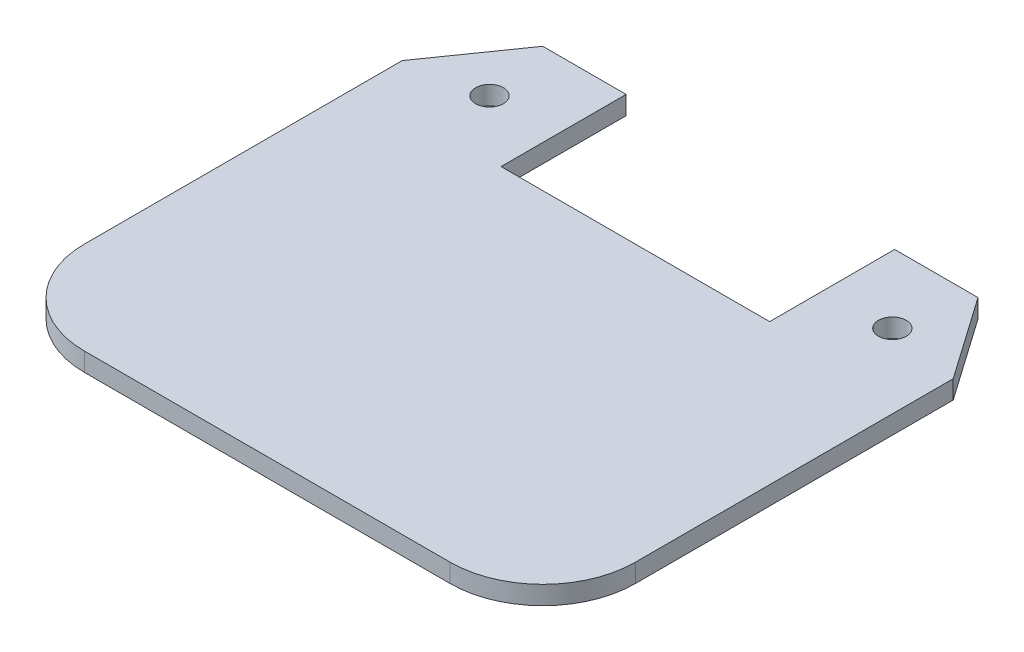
ISO-10303-21;
HEADER;
FILE_DESCRIPTION(('STEP AP214'),'2;1');
FILE_NAME('part.step','',(''),(''),'','','');
FILE_SCHEMA(('AUTOMOTIVE_DESIGN { 1 0 10303 214 1 1 1 1 }'));
ENDSEC;
DATA;
#1=APPLICATION_CONTEXT('core data for automotive mechanical design processes');
#2=APPLICATION_PROTOCOL_DEFINITION('international standard','automotive_design',2000,#1);
#3=PRODUCT_CONTEXT('',#1,'mechanical');
#4=PRODUCT('Part','Part','',(#3));
#5=PRODUCT_RELATED_PRODUCT_CATEGORY('part','',(#4));
#6=PRODUCT_DEFINITION_FORMATION('','',#4);
#7=PRODUCT_DEFINITION_CONTEXT('part definition',#1,'design');
#8=PRODUCT_DEFINITION('design','',#6,#7);
#9=PRODUCT_DEFINITION_SHAPE('','',#8);
#10=(LENGTH_UNIT() NAMED_UNIT(*) SI_UNIT(.MILLI.,.METRE.));
#11=(NAMED_UNIT(*) PLANE_ANGLE_UNIT() SI_UNIT($,.RADIAN.));
#12=(NAMED_UNIT(*) SI_UNIT($,.STERADIAN.) SOLID_ANGLE_UNIT());
#13=UNCERTAINTY_MEASURE_WITH_UNIT(LENGTH_MEASURE(1.E-05),#10,'distance_accuracy_value','');
#14=(GEOMETRIC_REPRESENTATION_CONTEXT(3) GLOBAL_UNCERTAINTY_ASSIGNED_CONTEXT((#13)) GLOBAL_UNIT_ASSIGNED_CONTEXT((#10,
#11,#12)) REPRESENTATION_CONTEXT('',''));
#15=CARTESIAN_POINT('',(0.,0.,0.));
#16=DIRECTION('',(0.,0.,1.));
#17=DIRECTION('',(1.,0.,0.));
#18=AXIS2_PLACEMENT_3D('',#15,#16,#17);
#19=CARTESIAN_POINT('',(4.7,0.4,-5.325));
#20=DIRECTION('',(0.,0.,1.));
#21=DIRECTION('',(1.,0.,0.));
#22=AXIS2_PLACEMENT_3D('',#19,#20,#21);
#23=PLANE('',#22);
#24=DIRECTION('',(-1.,0.,0.));
#25=VECTOR('',#24,1.);
#26=CARTESIAN_POINT('',(4.7,0.,-5.325));
#27=LINE('',#26,#25);
#28=CARTESIAN_POINT('',(4.7,0.,-5.325));
#29=VERTEX_POINT('',#28);
#30=CARTESIAN_POINT('',(2.9,0.,-5.325));
#31=VERTEX_POINT('',#30);
#32=EDGE_CURVE('E146',#29,#31,#27,.T.);
#33=ORIENTED_EDGE('',*,*,#32,.T.);
#34=DIRECTION('',(0.,1.,0.));
#35=VECTOR('',#34,1.);
#36=CARTESIAN_POINT('',(2.9,-9.6,-5.325));
#37=LINE('',#36,#35);
#38=CARTESIAN_POINT('',(2.9,0.4,-5.325));
#39=VERTEX_POINT('',#38);
#40=EDGE_CURVE('E130',#31,#39,#37,.T.);
#41=ORIENTED_EDGE('',*,*,#40,.T.);
#42=DIRECTION('',(-1.,0.,0.));
#43=VECTOR('',#42,1.);
#44=CARTESIAN_POINT('',(4.7,0.4,-5.325));
#45=LINE('',#44,#43);
#46=CARTESIAN_POINT('',(4.7,0.4,-5.325));
#47=VERTEX_POINT('',#46);
#48=EDGE_CURVE('E144',#47,#39,#45,.T.);
#49=ORIENTED_EDGE('',*,*,#48,.F.);
#50=DIRECTION('',(0.,-1.,0.));
#51=VECTOR('',#50,1.);
#52=CARTESIAN_POINT('',(4.7,0.4,-5.325));
#53=LINE('',#52,#51);
#54=EDGE_CURVE('E182',#47,#29,#53,.T.);
#55=ORIENTED_EDGE('',*,*,#54,.T.);
#56=EDGE_LOOP('',(#33,#41,#49,#55));
#57=FACE_BOUND('',#56,.T.);
#58=ADVANCED_FACE('F36',(#57),#23,.F.);
#59=CARTESIAN_POINT('',(-5.95,0.4,-3.53981499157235));
#60=DIRECTION('',(1.,0.,0.));
#61=DIRECTION('',(0.,0.,-1.));
#62=AXIS2_PLACEMENT_3D('',#59,#60,#61);
#63=PLANE('',#62);
#64=DIRECTION('',(0.,0.,1.));
#65=VECTOR('',#64,1.);
#66=CARTESIAN_POINT('',(-5.95,0.,-3.53981499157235));
#67=LINE('',#66,#65);
#68=CARTESIAN_POINT('',(-5.95,0.,-3.53981499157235));
#69=VERTEX_POINT('',#68);
#70=CARTESIAN_POINT('',(-5.95,0.,3.325));
#71=VERTEX_POINT('',#70);
#72=EDGE_CURVE('E162',#69,#71,#67,.T.);
#73=ORIENTED_EDGE('',*,*,#72,.T.);
#74=DIRECTION('',(0.,-1.,0.));
#75=VECTOR('',#74,1.);
#76=CARTESIAN_POINT('',(-5.95,0.4,3.325));
#77=LINE('',#76,#75);
#78=CARTESIAN_POINT('',(-5.95,0.4,3.325));
#79=VERTEX_POINT('',#78);
#80=EDGE_CURVE('E59',#71,#79,#77,.F.);
#81=ORIENTED_EDGE('',*,*,#80,.T.);
#82=DIRECTION('',(0.,0.,1.));
#83=VECTOR('',#82,1.);
#84=CARTESIAN_POINT('',(-5.95,0.4,-3.53981499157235));
#85=LINE('',#84,#83);
#86=CARTESIAN_POINT('',(-5.95,0.4,-3.53981499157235));
#87=VERTEX_POINT('',#86);
#88=EDGE_CURVE('E176',#87,#79,#85,.T.);
#89=ORIENTED_EDGE('',*,*,#88,.F.);
#90=DIRECTION('',(0.,-1.,0.));
#91=VECTOR('',#90,1.);
#92=CARTESIAN_POINT('',(-5.95,0.4,-3.53981499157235));
#93=LINE('',#92,#91);
#94=EDGE_CURVE('E157',#87,#69,#93,.T.);
#95=ORIENTED_EDGE('',*,*,#94,.T.);
#96=EDGE_LOOP('',(#73,#81,#89,#95));
#97=FACE_BOUND('',#96,.T.);
#98=ADVANCED_FACE('F226',(#97),#63,.F.);
#99=CARTESIAN_POINT('',(-5.95,0.4,5.325));
#100=DIRECTION('',(0.,0.,-1.));
#101=DIRECTION('',(-1.,0.,0.));
#102=AXIS2_PLACEMENT_3D('',#99,#100,#101);
#103=PLANE('',#102);
#104=DIRECTION('',(1.,0.,0.));
#105=VECTOR('',#104,1.);
#106=CARTESIAN_POINT('',(-5.95,0.4,5.325));
#107=LINE('',#106,#105);
#108=CARTESIAN_POINT('',(-3.95,0.4,5.325));
#109=VERTEX_POINT('',#108);
#110=CARTESIAN_POINT('',(3.95,0.4,5.325));
#111=VERTEX_POINT('',#110);
#112=EDGE_CURVE('E212',#109,#111,#107,.T.);
#113=ORIENTED_EDGE('',*,*,#112,.F.);
#114=DIRECTION('',(0.,-1.,0.));
#115=VECTOR('',#114,1.);
#116=CARTESIAN_POINT('',(-3.95,0.4,5.325));
#117=LINE('',#116,#115);
#118=CARTESIAN_POINT('',(-3.95,0.,5.325));
#119=VERTEX_POINT('',#118);
#120=EDGE_CURVE('E202',#109,#119,#117,.T.);
#121=ORIENTED_EDGE('',*,*,#120,.T.);
#122=DIRECTION('',(1.,0.,0.));
#123=VECTOR('',#122,1.);
#124=CARTESIAN_POINT('',(-5.95,0.,5.325));
#125=LINE('',#124,#123);
#126=CARTESIAN_POINT('',(3.95,0.,5.325));
#127=VERTEX_POINT('',#126);
#128=EDGE_CURVE('E164',#119,#127,#125,.T.);
#129=ORIENTED_EDGE('',*,*,#128,.T.);
#130=DIRECTION('',(0.,-1.,0.));
#131=VECTOR('',#130,1.);
#132=CARTESIAN_POINT('',(3.95,0.4,5.325));
#133=LINE('',#132,#131);
#134=EDGE_CURVE('E195',#127,#111,#133,.F.);
#135=ORIENTED_EDGE('',*,*,#134,.T.);
#136=EDGE_LOOP('',(#113,#121,#129,#135));
#137=FACE_BOUND('',#136,.T.);
#138=ADVANCED_FACE('F216',(#137),#103,.F.);
#139=CARTESIAN_POINT('',(5.95,0.4,-3.53981499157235));
#140=DIRECTION('',(-1.,0.,0.));
#141=DIRECTION('',(0.,0.,1.));
#142=AXIS2_PLACEMENT_3D('',#139,#140,#141);
#143=PLANE('',#142);
#144=DIRECTION('',(0.,0.,-1.));
#145=VECTOR('',#144,1.);
#146=CARTESIAN_POINT('',(5.95,0.4,-3.53981499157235));
#147=LINE('',#146,#145);
#148=CARTESIAN_POINT('',(5.95,0.4,3.325));
#149=VERTEX_POINT('',#148);
#150=CARTESIAN_POINT('',(5.95,0.4,-3.53981499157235));
#151=VERTEX_POINT('',#150);
#152=EDGE_CURVE('E219',#149,#151,#147,.T.);
#153=ORIENTED_EDGE('',*,*,#152,.F.);
#154=DIRECTION('',(0.,-1.,0.));
#155=VECTOR('',#154,1.);
#156=CARTESIAN_POINT('',(5.95,0.4,3.325));
#157=LINE('',#156,#155);
#158=CARTESIAN_POINT('',(5.95,0.,3.325));
#159=VERTEX_POINT('',#158);
#160=EDGE_CURVE('E11',#149,#159,#157,.T.);
#161=ORIENTED_EDGE('',*,*,#160,.T.);
#162=DIRECTION('',(0.,0.,-1.));
#163=VECTOR('',#162,1.);
#164=CARTESIAN_POINT('',(5.95,0.,-3.53981499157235));
#165=LINE('',#164,#163);
#166=CARTESIAN_POINT('',(5.95,0.,-3.53981499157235));
#167=VERTEX_POINT('',#166);
#168=EDGE_CURVE('E168',#159,#167,#165,.T.);
#169=ORIENTED_EDGE('',*,*,#168,.T.);
#170=DIRECTION('',(0.,-1.,0.));
#171=VECTOR('',#170,1.);
#172=CARTESIAN_POINT('',(5.95,0.4,-3.53981499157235));
#173=LINE('',#172,#171);
#174=EDGE_CURVE('E184',#151,#167,#173,.T.);
#175=ORIENTED_EDGE('',*,*,#174,.F.);
#176=EDGE_LOOP('',(#153,#161,#169,#175));
#177=FACE_BOUND('',#176,.T.);
#178=ADVANCED_FACE('F248',(#177),#143,.F.);
#179=CARTESIAN_POINT('',(5.95,0.4,-3.53981499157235));
#180=DIRECTION('',(-0.819152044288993,0.,0.573576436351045));
#181=DIRECTION('',(0.573576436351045,0.,0.819152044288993));
#182=AXIS2_PLACEMENT_3D('',#179,#180,#181);
#183=PLANE('',#182);
#184=DIRECTION('',(-0.573576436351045,0.,-0.819152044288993));
#185=VECTOR('',#184,1.);
#186=CARTESIAN_POINT('',(5.95,0.,-3.53981499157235));
#187=LINE('',#186,#185);
#188=EDGE_CURVE('E170',#167,#29,#187,.T.);
#189=ORIENTED_EDGE('',*,*,#188,.T.);
#190=ORIENTED_EDGE('',*,*,#54,.F.);
#191=DIRECTION('',(-0.573576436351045,0.,-0.819152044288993));
#192=VECTOR('',#191,1.);
#193=CARTESIAN_POINT('',(5.95,0.4,-3.53981499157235));
#194=LINE('',#193,#192);
#195=EDGE_CURVE('E152',#151,#47,#194,.T.);
#196=ORIENTED_EDGE('',*,*,#195,.F.);
#197=ORIENTED_EDGE('',*,*,#174,.T.);
#198=EDGE_LOOP('',(#189,#190,#196,#197));
#199=FACE_BOUND('',#198,.T.);
#200=ADVANCED_FACE('F252',(#199),#183,.F.);
#201=CARTESIAN_POINT('',(-2.9,0.4,-5.325));
#202=VERTEX_POINT('',#201);
#203=CARTESIAN_POINT('',(-4.7,0.4,-5.325));
#204=VERTEX_POINT('',#203);
#205=EDGE_CURVE('E155',#202,#204,#45,.T.);
#206=ORIENTED_EDGE('',*,*,#205,.F.);
#207=DIRECTION('',(0.,1.,0.));
#208=VECTOR('',#207,1.);
#209=CARTESIAN_POINT('',(-2.9,-9.6,-5.325));
#210=LINE('',#209,#208);
#211=CARTESIAN_POINT('',(-2.9,0.,-5.325));
#212=VERTEX_POINT('',#211);
#213=EDGE_CURVE('E147',#212,#202,#210,.T.);
#214=ORIENTED_EDGE('',*,*,#213,.F.);
#215=CARTESIAN_POINT('',(-4.7,0.,-5.325));
#216=VERTEX_POINT('',#215);
#217=EDGE_CURVE('E172',#212,#216,#27,.T.);
#218=ORIENTED_EDGE('',*,*,#217,.T.);
#219=DIRECTION('',(0.,-1.,0.));
#220=VECTOR('',#219,1.);
#221=CARTESIAN_POINT('',(-4.7,0.4,-5.325));
#222=LINE('',#221,#220);
#223=EDGE_CURVE('E179',#204,#216,#222,.T.);
#224=ORIENTED_EDGE('',*,*,#223,.F.);
#225=EDGE_LOOP('',(#206,#214,#218,#224));
#226=FACE_BOUND('',#225,.T.);
#227=ADVANCED_FACE('F236',(#226),#23,.F.);
#228=CARTESIAN_POINT('',(-4.7,0.4,-5.325));
#229=DIRECTION('',(0.819152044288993,0.,0.573576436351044));
#230=DIRECTION('',(0.573576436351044,0.,-0.819152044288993));
#231=AXIS2_PLACEMENT_3D('',#228,#229,#230);
#232=PLANE('',#231);
#233=DIRECTION('',(-0.573576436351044,0.,0.819152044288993));
#234=VECTOR('',#233,1.);
#235=CARTESIAN_POINT('',(-4.7,0.,-5.325));
#236=LINE('',#235,#234);
#237=EDGE_CURVE('E174',#216,#69,#236,.T.);
#238=ORIENTED_EDGE('',*,*,#237,.T.);
#239=ORIENTED_EDGE('',*,*,#94,.F.);
#240=DIRECTION('',(-0.573576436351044,0.,0.819152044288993));
#241=VECTOR('',#240,1.);
#242=CARTESIAN_POINT('',(-4.7,0.4,-5.325));
#243=LINE('',#242,#241);
#244=EDGE_CURVE('E154',#204,#87,#243,.T.);
#245=ORIENTED_EDGE('',*,*,#244,.F.);
#246=ORIENTED_EDGE('',*,*,#223,.T.);
#247=EDGE_LOOP('',(#238,#239,#245,#246));
#248=FACE_BOUND('',#247,.T.);
#249=ADVANCED_FACE('F230',(#248),#232,.F.);
#250=CARTESIAN_POINT('',(0.,0.4,0.));
#251=DIRECTION('',(0.,1.,0.));
#252=DIRECTION('',(0.,0.,1.));
#253=AXIS2_PLACEMENT_3D('',#250,#251,#252);
#254=PLANE('',#253);
#255=CARTESIAN_POINT('',(4.35,0.4,-3.825));
#256=DIRECTION('',(0.,1.,0.));
#257=DIRECTION('',(0.,0.,1.));
#258=AXIS2_PLACEMENT_3D('',#255,#256,#257);
#259=CIRCLE('',#258,0.3);
#260=CARTESIAN_POINT('',(4.35,0.4,-3.525));
#261=VERTEX_POINT('',#260);
#262=EDGE_CURVE('E259',#261,#261,#259,.T.);
#263=ORIENTED_EDGE('',*,*,#262,.F.);
#264=EDGE_LOOP('',(#263));
#265=FACE_BOUND('',#264,.T.);
#266=CARTESIAN_POINT('',(-4.35,0.4,-3.825));
#267=DIRECTION('',(0.,1.,0.));
#268=DIRECTION('',(0.,0.,1.));
#269=AXIS2_PLACEMENT_3D('',#266,#267,#268);
#270=CIRCLE('',#269,0.3);
#271=CARTESIAN_POINT('',(-4.35,0.4,-3.525));
#272=VERTEX_POINT('',#271);
#273=EDGE_CURVE('E138',#272,#272,#270,.T.);
#274=ORIENTED_EDGE('',*,*,#273,.F.);
#275=EDGE_LOOP('',(#274));
#276=FACE_BOUND('',#275,.T.);
#277=ORIENTED_EDGE('',*,*,#88,.T.);
#278=CARTESIAN_POINT('',(-3.95,0.4,3.325));
#279=DIRECTION('',(0.,1.,0.));
#280=DIRECTION('',(0.,0.,1.));
#281=AXIS2_PLACEMENT_3D('',#278,#279,#280);
#282=CIRCLE('',#281,2.);
#283=EDGE_CURVE('E44',#79,#109,#282,.T.);
#284=ORIENTED_EDGE('',*,*,#283,.T.);
#285=ORIENTED_EDGE('',*,*,#112,.T.);
#286=CARTESIAN_POINT('',(3.95,0.4,3.325));
#287=DIRECTION('',(0.,1.,0.));
#288=DIRECTION('',(0.,0.,1.));
#289=AXIS2_PLACEMENT_3D('',#286,#287,#288);
#290=CIRCLE('',#289,2.);
#291=EDGE_CURVE('E51',#111,#149,#290,.T.);
#292=ORIENTED_EDGE('',*,*,#291,.T.);
#293=ORIENTED_EDGE('',*,*,#152,.T.);
#294=ORIENTED_EDGE('',*,*,#195,.T.);
#295=ORIENTED_EDGE('',*,*,#48,.T.);
#296=DIRECTION('',(0.,0.,-1.));
#297=VECTOR('',#296,1.);
#298=CARTESIAN_POINT('',(2.9,0.4,-5.325));
#299=LINE('',#298,#297);
#300=CARTESIAN_POINT('',(2.9,0.4,-2.625));
#301=VERTEX_POINT('',#300);
#302=EDGE_CURVE('E127',#301,#39,#299,.T.);
#303=ORIENTED_EDGE('',*,*,#302,.F.);
#304=DIRECTION('',(1.,0.,0.));
#305=VECTOR('',#304,1.);
#306=CARTESIAN_POINT('',(2.9,0.4,-2.625));
#307=LINE('',#306,#305);
#308=CARTESIAN_POINT('',(-2.9,0.4,-2.625));
#309=VERTEX_POINT('',#308);
#310=EDGE_CURVE('E148',#309,#301,#307,.T.);
#311=ORIENTED_EDGE('',*,*,#310,.F.);
#312=DIRECTION('',(0.,0.,1.));
#313=VECTOR('',#312,1.);
#314=CARTESIAN_POINT('',(-2.9,0.4,-5.325));
#315=LINE('',#314,#313);
#316=EDGE_CURVE('E137',#202,#309,#315,.T.);
#317=ORIENTED_EDGE('',*,*,#316,.F.);
#318=ORIENTED_EDGE('',*,*,#205,.T.);
#319=ORIENTED_EDGE('',*,*,#244,.T.);
#320=EDGE_LOOP('',(#277,#284,#285,#292,#293,#294,#295,#303,#311,#317,#318,#319));
#321=FACE_BOUND('',#320,.T.);
#322=ADVANCED_FACE('F150',(#265,#276,#321),#254,.T.);
#323=CARTESIAN_POINT('',(0.,0.,0.));
#324=DIRECTION('',(0.,1.,0.));
#325=DIRECTION('',(0.,0.,1.));
#326=AXIS2_PLACEMENT_3D('',#323,#324,#325);
#327=PLANE('',#326);
#328=CARTESIAN_POINT('',(4.35,0.,-3.825));
#329=DIRECTION('',(0.,1.,0.));
#330=DIRECTION('',(0.,0.,1.));
#331=AXIS2_PLACEMENT_3D('',#328,#329,#330);
#332=CIRCLE('',#331,0.3);
#333=CARTESIAN_POINT('',(4.35,0.,-3.525));
#334=VERTEX_POINT('',#333);
#335=EDGE_CURVE('E165',#334,#334,#332,.T.);
#336=ORIENTED_EDGE('',*,*,#335,.T.);
#337=EDGE_LOOP('',(#336));
#338=FACE_BOUND('',#337,.T.);
#339=CARTESIAN_POINT('',(-4.35,0.,-3.825));
#340=DIRECTION('',(0.,1.,0.));
#341=DIRECTION('',(0.,0.,1.));
#342=AXIS2_PLACEMENT_3D('',#339,#340,#341);
#343=CIRCLE('',#342,0.3);
#344=CARTESIAN_POINT('',(-4.35,0.,-3.525));
#345=VERTEX_POINT('',#344);
#346=EDGE_CURVE('E196',#345,#345,#343,.T.);
#347=ORIENTED_EDGE('',*,*,#346,.T.);
#348=EDGE_LOOP('',(#347));
#349=FACE_BOUND('',#348,.T.);
#350=ORIENTED_EDGE('',*,*,#128,.F.);
#351=CARTESIAN_POINT('',(-3.95,0.,3.325));
#352=DIRECTION('',(0.,1.,0.));
#353=DIRECTION('',(0.,0.,1.));
#354=AXIS2_PLACEMENT_3D('',#351,#352,#353);
#355=CIRCLE('',#354,2.);
#356=EDGE_CURVE('E207',#119,#71,#355,.F.);
#357=ORIENTED_EDGE('',*,*,#356,.T.);
#358=ORIENTED_EDGE('',*,*,#72,.F.);
#359=ORIENTED_EDGE('',*,*,#237,.F.);
#360=ORIENTED_EDGE('',*,*,#217,.F.);
#361=DIRECTION('',(0.,0.,1.));
#362=VECTOR('',#361,1.);
#363=CARTESIAN_POINT('',(-2.9,0.,0.));
#364=LINE('',#363,#362);
#365=CARTESIAN_POINT('',(-2.9,0.,-2.625));
#366=VERTEX_POINT('',#365);
#367=EDGE_CURVE('E187',#212,#366,#364,.T.);
#368=ORIENTED_EDGE('',*,*,#367,.T.);
#369=DIRECTION('',(1.,0.,0.));
#370=VECTOR('',#369,1.);
#371=CARTESIAN_POINT('',(0.,0.,-2.625));
#372=LINE('',#371,#370);
#373=CARTESIAN_POINT('',(2.9,0.,-2.625));
#374=VERTEX_POINT('',#373);
#375=EDGE_CURVE('E190',#366,#374,#372,.T.);
#376=ORIENTED_EDGE('',*,*,#375,.T.);
#377=DIRECTION('',(0.,0.,-1.));
#378=VECTOR('',#377,1.);
#379=CARTESIAN_POINT('',(2.9,0.,0.));
#380=LINE('',#379,#378);
#381=EDGE_CURVE('E193',#374,#31,#380,.T.);
#382=ORIENTED_EDGE('',*,*,#381,.T.);
#383=ORIENTED_EDGE('',*,*,#32,.F.);
#384=ORIENTED_EDGE('',*,*,#188,.F.);
#385=ORIENTED_EDGE('',*,*,#168,.F.);
#386=CARTESIAN_POINT('',(3.95,0.,3.325));
#387=DIRECTION('',(0.,1.,0.));
#388=DIRECTION('',(0.,0.,1.));
#389=AXIS2_PLACEMENT_3D('',#386,#387,#388);
#390=CIRCLE('',#389,2.);
#391=EDGE_CURVE('E205',#159,#127,#390,.F.);
#392=ORIENTED_EDGE('',*,*,#391,.T.);
#393=EDGE_LOOP('',(#350,#357,#358,#359,#360,#368,#376,#382,#383,#384,#385,#392));
#394=FACE_BOUND('',#393,.T.);
#395=ADVANCED_FACE('F224',(#338,#349,#394),#327,.F.);
#396=CARTESIAN_POINT('',(2.9,-9.6,-5.325));
#397=DIRECTION('',(1.,0.,0.));
#398=DIRECTION('',(0.,0.,-1.));
#399=AXIS2_PLACEMENT_3D('',#396,#397,#398);
#400=PLANE('',#399);
#401=DIRECTION('',(0.,1.,0.));
#402=VECTOR('',#401,1.);
#403=CARTESIAN_POINT('',(2.9,-9.6,-2.625));
#404=LINE('',#403,#402);
#405=EDGE_CURVE('E133',#374,#301,#404,.T.);
#406=ORIENTED_EDGE('',*,*,#405,.T.);
#407=ORIENTED_EDGE('',*,*,#302,.T.);
#408=ORIENTED_EDGE('',*,*,#40,.F.);
#409=ORIENTED_EDGE('',*,*,#381,.F.);
#410=EDGE_LOOP('',(#406,#407,#408,#409));
#411=FACE_BOUND('',#410,.T.);
#412=ADVANCED_FACE('F129',(#411),#400,.F.);
#413=CARTESIAN_POINT('',(2.9,-9.6,-2.625));
#414=DIRECTION('',(0.,0.,1.));
#415=DIRECTION('',(1.,0.,0.));
#416=AXIS2_PLACEMENT_3D('',#413,#414,#415);
#417=PLANE('',#416);
#418=DIRECTION('',(0.,1.,0.));
#419=VECTOR('',#418,1.);
#420=CARTESIAN_POINT('',(-2.9,-9.6,-2.625));
#421=LINE('',#420,#419);
#422=EDGE_CURVE('E240',#366,#309,#421,.T.);
#423=ORIENTED_EDGE('',*,*,#422,.T.);
#424=ORIENTED_EDGE('',*,*,#310,.T.);
#425=ORIENTED_EDGE('',*,*,#405,.F.);
#426=ORIENTED_EDGE('',*,*,#375,.F.);
#427=EDGE_LOOP('',(#423,#424,#425,#426));
#428=FACE_BOUND('',#427,.T.);
#429=ADVANCED_FACE('F255',(#428),#417,.F.);
#430=CARTESIAN_POINT('',(-2.9,-9.6,-5.325));
#431=DIRECTION('',(-1.,0.,0.));
#432=DIRECTION('',(0.,0.,1.));
#433=AXIS2_PLACEMENT_3D('',#430,#431,#432);
#434=PLANE('',#433);
#435=ORIENTED_EDGE('',*,*,#213,.T.);
#436=ORIENTED_EDGE('',*,*,#316,.T.);
#437=ORIENTED_EDGE('',*,*,#422,.F.);
#438=ORIENTED_EDGE('',*,*,#367,.F.);
#439=EDGE_LOOP('',(#435,#436,#437,#438));
#440=FACE_BOUND('',#439,.T.);
#441=ADVANCED_FACE('F309',(#440),#434,.F.);
#442=CARTESIAN_POINT('',(-4.35,-9.6,-3.825));
#443=DIRECTION('',(0.,1.,0.));
#444=DIRECTION('',(0.,0.,1.));
#445=AXIS2_PLACEMENT_3D('',#442,#443,#444);
#446=CYLINDRICAL_SURFACE('',#445,0.3);
#447=ORIENTED_EDGE('',*,*,#273,.T.);
#448=EDGE_LOOP('',(#447));
#449=FACE_BOUND('',#448,.T.);
#450=ORIENTED_EDGE('',*,*,#346,.F.);
#451=EDGE_LOOP('',(#450));
#452=FACE_BOUND('',#451,.T.);
#453=ADVANCED_FACE('F265',(#449,#452),#446,.F.);
#454=CARTESIAN_POINT('',(4.35,-9.6,-3.825));
#455=DIRECTION('',(0.,1.,0.));
#456=DIRECTION('',(0.,0.,1.));
#457=AXIS2_PLACEMENT_3D('',#454,#455,#456);
#458=CYLINDRICAL_SURFACE('',#457,0.3);
#459=ORIENTED_EDGE('',*,*,#262,.T.);
#460=EDGE_LOOP('',(#459));
#461=FACE_BOUND('',#460,.T.);
#462=ORIENTED_EDGE('',*,*,#335,.F.);
#463=EDGE_LOOP('',(#462));
#464=FACE_BOUND('',#463,.T.);
#465=ADVANCED_FACE('F298',(#461,#464),#458,.F.);
#466=CARTESIAN_POINT('',(-3.95,0.4,3.325));
#467=DIRECTION('',(0.,-1.,0.));
#468=DIRECTION('',(0.,0.,-1.));
#469=AXIS2_PLACEMENT_3D('',#466,#467,#468);
#470=CYLINDRICAL_SURFACE('',#469,2.);
#471=ORIENTED_EDGE('',*,*,#283,.F.);
#472=ORIENTED_EDGE('',*,*,#80,.F.);
#473=ORIENTED_EDGE('',*,*,#356,.F.);
#474=ORIENTED_EDGE('',*,*,#120,.F.);
#475=EDGE_LOOP('',(#471,#472,#473,#474));
#476=FACE_BOUND('',#475,.T.);
#477=ADVANCED_FACE('F221',(#476),#470,.T.);
#478=CARTESIAN_POINT('',(3.95,0.4,3.325));
#479=DIRECTION('',(0.,-1.,0.));
#480=DIRECTION('',(0.,0.,-1.));
#481=AXIS2_PLACEMENT_3D('',#478,#479,#480);
#482=CYLINDRICAL_SURFACE('',#481,2.);
#483=ORIENTED_EDGE('',*,*,#291,.F.);
#484=ORIENTED_EDGE('',*,*,#134,.F.);
#485=ORIENTED_EDGE('',*,*,#391,.F.);
#486=ORIENTED_EDGE('',*,*,#160,.F.);
#487=EDGE_LOOP('',(#483,#484,#485,#486));
#488=FACE_BOUND('',#487,.T.);
#489=ADVANCED_FACE('F38',(#488),#482,.T.);
#490=CLOSED_SHELL('',(#58,#98,#138,#178,#200,#227,#249,#322,#395,#412,#429,#441,#453,#465,#477,#489));
#491=MANIFOLD_SOLID_BREP('B2',#490);
#492=ADVANCED_BREP_SHAPE_REPRESENTATION('',(#18,#491),#14);
#493=SHAPE_DEFINITION_REPRESENTATION(#9,#492);
ENDSEC;
END-ISO-10303-21;
